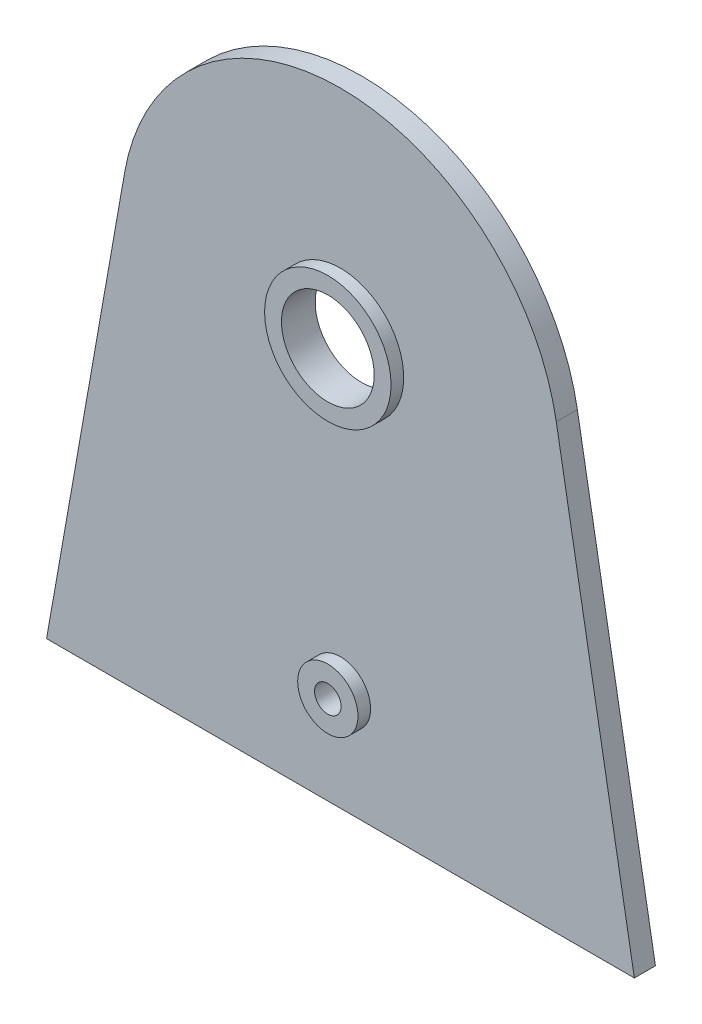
from build123d import *

# Parameters (mm, degrees)
SKETCH1_R           = 3.15
SKETCH1_R_2         = 11
BOSS_EXTRUDE1_DEPTH = 5
BOSS_EXTRUDE2_START = 3
SKETCH2_R           = 15
SKETCH2_R_2         = 11
SKETCH2_R_3         = 7.15
SKETCH2_R_4         = 3.15
BOSS_EXTRUDE2_DEPTH = 3


with BuildPart() as part:
    # Sketch1 → Boss-Extrude1 (new body)
    with BuildSketch(Plane.XY):
        with BuildLine():
            Line((-69.729573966, -24), (69.729573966, -24))
            Line((69.729573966, -24), (51.210003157, 81.029705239))
            ThreePointArc((51.210003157, 81.029705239), (0, 124), (-51.210003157, 81.029705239))
            Line((-51.210003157, 81.029705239), (-69.729573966, -24))
        make_face()
        Circle(SKETCH1_R, mode=Mode.SUBTRACT)
        with Locations((0, 72)):
            Circle(SKETCH1_R_2, mode=Mode.SUBTRACT)
    extrude(amount=-BOSS_EXTRUDE1_DEPTH)

    # Sketch2 → Boss-Extrude2 (add)
    # profile 1 of 2: a face of its own
    with BuildSketch(Plane.XY.offset(BOSS_EXTRUDE2_START)):
        with Locations(Location((0, 72, 0), (0, 0, 180))):
            Circle(SKETCH2_R)
        with Locations((0, 72)):
            Circle(SKETCH2_R_2, mode=Mode.SUBTRACT)
    # profile 2 of 2: a face of its own
    with BuildSketch(Plane.XY.offset(BOSS_EXTRUDE2_START)):
        with Locations(Location((0, 0, 0), (0, 0, 180))):
            Circle(SKETCH2_R_3)
        Circle(SKETCH2_R_4, mode=Mode.SUBTRACT)
    extrude(amount=-BOSS_EXTRUDE2_DEPTH)


solid = part.part
